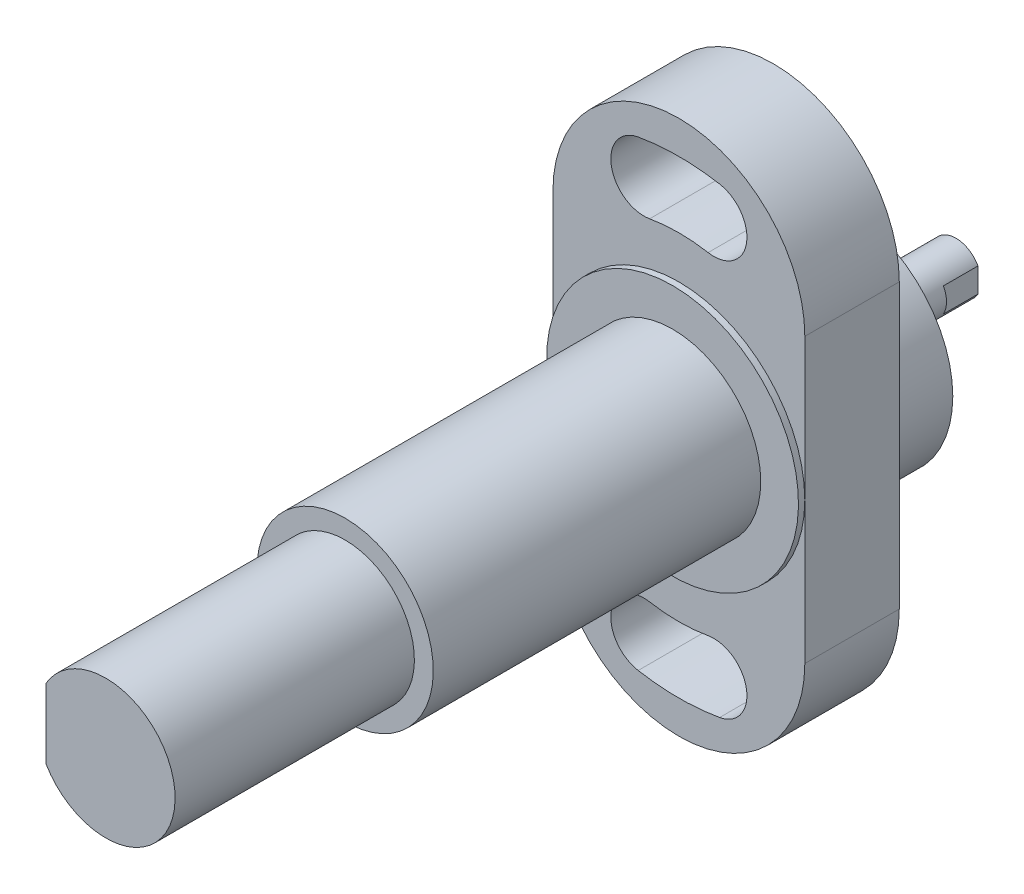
ISO-10303-21;
HEADER;
FILE_DESCRIPTION(('STEP AP214'),'2;1');
FILE_NAME('part.step','',(''),(''),'','','');
FILE_SCHEMA(('AUTOMOTIVE_DESIGN { 1 0 10303 214 1 1 1 1 }'));
ENDSEC;
DATA;
#1=APPLICATION_CONTEXT('core data for automotive mechanical design processes');
#2=APPLICATION_PROTOCOL_DEFINITION('international standard','automotive_design',2000,#1);
#3=PRODUCT_CONTEXT('',#1,'mechanical');
#4=PRODUCT('Part','Part','',(#3));
#5=PRODUCT_RELATED_PRODUCT_CATEGORY('part','',(#4));
#6=PRODUCT_DEFINITION_FORMATION('','',#4);
#7=PRODUCT_DEFINITION_CONTEXT('part definition',#1,'design');
#8=PRODUCT_DEFINITION('design','',#6,#7);
#9=PRODUCT_DEFINITION_SHAPE('','',#8);
#10=(LENGTH_UNIT() NAMED_UNIT(*) SI_UNIT(.MILLI.,.METRE.));
#11=(NAMED_UNIT(*) PLANE_ANGLE_UNIT() SI_UNIT($,.RADIAN.));
#12=(NAMED_UNIT(*) SI_UNIT($,.STERADIAN.) SOLID_ANGLE_UNIT());
#13=UNCERTAINTY_MEASURE_WITH_UNIT(LENGTH_MEASURE(1.E-05),#10,'distance_accuracy_value','');
#14=(GEOMETRIC_REPRESENTATION_CONTEXT(3) GLOBAL_UNCERTAINTY_ASSIGNED_CONTEXT((#13)) GLOBAL_UNIT_ASSIGNED_CONTEXT((#10,
#11,#12)) REPRESENTATION_CONTEXT('',''));
#15=CARTESIAN_POINT('',(0.,0.,0.));
#16=DIRECTION('',(0.,0.,1.));
#17=DIRECTION('',(1.,0.,0.));
#18=AXIS2_PLACEMENT_3D('',#15,#16,#17);
#19=CARTESIAN_POINT('',(-10.,0.,-11.));
#20=DIRECTION('',(0.,0.,-1.));
#21=DIRECTION('',(0.,1.,0.));
#22=AXIS2_PLACEMENT_3D('',#19,#20,#21);
#23=PLANE('',#22);
#24=CARTESIAN_POINT('',(0.,0.,-11.));
#25=DIRECTION('',(0.,0.,1.));
#26=DIRECTION('',(0.,1.,0.));
#27=AXIS2_PLACEMENT_3D('',#24,#25,#26);
#28=CIRCLE('',#27,17.5);
#29=CARTESIAN_POINT('',(0.,17.5,-11.));
#30=VERTEX_POINT('',#29);
#31=EDGE_CURVE('E212',#30,#30,#28,.T.);
#32=ORIENTED_EDGE('',*,*,#31,.F.);
#33=EDGE_LOOP('',(#32));
#34=FACE_BOUND('',#33,.T.);
#35=CARTESIAN_POINT('',(0.,0.,-11.));
#36=DIRECTION('',(0.,0.,-1.));
#37=DIRECTION('',(-1.,0.,0.));
#38=AXIS2_PLACEMENT_3D('',#35,#36,#37);
#39=CIRCLE('',#38,4.);
#40=CARTESIAN_POINT('',(-4.,0.,-11.));
#41=VERTEX_POINT('',#40);
#42=EDGE_CURVE('E180',#41,#41,#39,.T.);
#43=ORIENTED_EDGE('',*,*,#42,.F.);
#44=EDGE_LOOP('',(#43));
#45=FACE_BOUND('',#44,.T.);
#46=ADVANCED_FACE('F14',(#34,#45),#23,.T.);
#47=CARTESIAN_POINT('',(-9.5,0.,101.));
#48=DIRECTION('',(-1.,0.,0.));
#49=DIRECTION('',(0.,1.,0.));
#50=AXIS2_PLACEMENT_3D('',#47,#48,#49);
#51=CONICAL_SURFACE('',#50,2.65,0.785398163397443);
#52=CARTESIAN_POINT('',(-9.35,0.,101.));
#53=DIRECTION('',(-1.,0.,0.));
#54=DIRECTION('',(0.,0.,1.));
#55=AXIS2_PLACEMENT_3D('',#52,#53,#54);
#56=CIRCLE('',#55,2.5);
#57=CARTESIAN_POINT('',(-9.35,0.,103.5));
#58=VERTEX_POINT('',#57);
#59=EDGE_CURVE('E329',#58,#58,#56,.F.);
#60=ORIENTED_EDGE('',*,*,#59,.T.);
#61=EDGE_LOOP('',(#60));
#62=FACE_BOUND('',#61,.T.);
#63=CARTESIAN_POINT('',(-9.5,0.,101.));
#64=DIRECTION('',(1.,0.,0.));
#65=DIRECTION('',(0.,1.,0.));
#66=AXIS2_PLACEMENT_3D('',#63,#64,#65);
#67=CIRCLE('',#66,2.65);
#68=CARTESIAN_POINT('',(-9.5,2.65,101.));
#69=VERTEX_POINT('',#68);
#70=EDGE_CURVE('E215',#69,#69,#67,.T.);
#71=ORIENTED_EDGE('',*,*,#70,.F.);
#72=EDGE_LOOP('',(#71));
#73=FACE_BOUND('',#72,.T.);
#74=ADVANCED_FACE('F367',(#62,#73),#51,.F.);
#75=CARTESIAN_POINT('',(-9.5,10.,95.));
#76=DIRECTION('',(0.5,0.,-0.866025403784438));
#77=DIRECTION('',(-0.866025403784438,0.,-0.5));
#78=AXIS2_PLACEMENT_3D('',#75,#76,#77);
#79=PLANE('',#78);
#80=CARTESIAN_POINT('',(0.,0.,100.484827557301));
#81=DIRECTION('',(-0.5,0.,0.866025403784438));
#82=DIRECTION('',(-0.866025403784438,0.,-0.5));
#83=AXIS2_PLACEMENT_3D('',#80,#81,#82);
#84=ELLIPSE('',#83,12.7017059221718,11.);
#85=CARTESIAN_POINT('',(-9.5,5.54526825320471,95.));
#86=VERTEX_POINT('',#85);
#87=CARTESIAN_POINT('',(-9.5,-5.54526825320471,95.));
#88=VERTEX_POINT('',#87);
#89=EDGE_CURVE('E23',#86,#88,#84,.T.);
#90=ORIENTED_EDGE('',*,*,#89,.T.);
#91=DIRECTION('',(0.,-1.,0.));
#92=VECTOR('',#91,1.);
#93=CARTESIAN_POINT('',(-9.5,10.,95.));
#94=LINE('',#93,#92);
#95=EDGE_CURVE('E221',#86,#88,#94,.T.);
#96=ORIENTED_EDGE('',*,*,#95,.F.);
#97=EDGE_LOOP('',(#90,#96));
#98=FACE_BOUND('',#97,.T.);
#99=ADVANCED_FACE('F374',(#98),#79,.F.);
#100=CARTESIAN_POINT('',(-9.5,10.,106.));
#101=DIRECTION('',(1.,0.,0.));
#102=DIRECTION('',(0.,0.,-1.));
#103=AXIS2_PLACEMENT_3D('',#100,#101,#102);
#104=PLANE('',#103);
#105=DIRECTION('',(0.,1.,0.));
#106=VECTOR('',#105,1.);
#107=CARTESIAN_POINT('',(-9.5,5.54526825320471,106.));
#108=LINE('',#107,#106);
#109=CARTESIAN_POINT('',(-9.5,-5.54526825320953,106.));
#110=VERTEX_POINT('',#109);
#111=CARTESIAN_POINT('',(-9.5,5.54526825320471,106.));
#112=VERTEX_POINT('',#111);
#113=EDGE_CURVE('E202',#110,#112,#108,.T.);
#114=ORIENTED_EDGE('',*,*,#113,.T.);
#115=DIRECTION('',(0.,0.,-1.));
#116=VECTOR('',#115,1.);
#117=CARTESIAN_POINT('',(-9.5,5.54526825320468,0.));
#118=LINE('',#117,#116);
#119=EDGE_CURVE('E227',#112,#86,#118,.T.);
#120=ORIENTED_EDGE('',*,*,#119,.T.);
#121=ORIENTED_EDGE('',*,*,#95,.T.);
#122=DIRECTION('',(0.,0.,-1.));
#123=VECTOR('',#122,1.);
#124=CARTESIAN_POINT('',(-9.5,-5.54526825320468,0.));
#125=LINE('',#124,#123);
#126=EDGE_CURVE('E224',#88,#110,#125,.F.);
#127=ORIENTED_EDGE('',*,*,#126,.T.);
#128=EDGE_LOOP('',(#114,#120,#121,#127));
#129=FACE_BOUND('',#128,.T.);
#130=ORIENTED_EDGE('',*,*,#70,.T.);
#131=EDGE_LOOP('',(#130));
#132=FACE_BOUND('',#131,.T.);
#133=ADVANCED_FACE('F395',(#129,#132),#104,.F.);
#134=CARTESIAN_POINT('',(0.,0.,0.));
#135=DIRECTION('',(0.,0.,-1.));
#136=DIRECTION('',(0.,1.,0.));
#137=AXIS2_PLACEMENT_3D('',#134,#135,#136);
#138=CYLINDRICAL_SURFACE('',#137,11.);
#139=ORIENTED_EDGE('',*,*,#119,.F.);
#140=CARTESIAN_POINT('',(0.,0.,106.));
#141=DIRECTION('',(0.,0.,-1.));
#142=DIRECTION('',(1.,0.,0.));
#143=AXIS2_PLACEMENT_3D('',#140,#141,#142);
#144=CIRCLE('',#143,11.0000000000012);
#145=EDGE_CURVE('E200',#112,#110,#144,.T.);
#146=ORIENTED_EDGE('',*,*,#145,.T.);
#147=ORIENTED_EDGE('',*,*,#126,.F.);
#148=ORIENTED_EDGE('',*,*,#89,.F.);
#149=EDGE_LOOP('',(#139,#146,#147,#148));
#150=FACE_BOUND('',#149,.T.);
#151=CARTESIAN_POINT('',(0.,0.,68.));
#152=DIRECTION('',(0.,0.,1.));
#153=DIRECTION('',(0.,1.,0.));
#154=AXIS2_PLACEMENT_3D('',#151,#152,#153);
#155=CIRCLE('',#154,11.);
#156=CARTESIAN_POINT('',(0.,11.,68.));
#157=VERTEX_POINT('',#156);
#158=EDGE_CURVE('E282',#157,#157,#155,.T.);
#159=ORIENTED_EDGE('',*,*,#158,.T.);
#160=EDGE_LOOP('',(#159));
#161=FACE_BOUND('',#160,.T.);
#162=ADVANCED_FACE('F399',(#150,#161),#138,.T.);
#163=CARTESIAN_POINT('',(-14.,0.,68.));
#164=DIRECTION('',(0.,0.,-1.));
#165=DIRECTION('',(0.,1.,0.));
#166=AXIS2_PLACEMENT_3D('',#163,#164,#165);
#167=PLANE('',#166);
#168=CARTESIAN_POINT('',(0.,0.,68.));
#169=DIRECTION('',(0.,0.,1.));
#170=DIRECTION('',(0.,1.,0.));
#171=AXIS2_PLACEMENT_3D('',#168,#169,#170);
#172=CIRCLE('',#171,14.);
#173=CARTESIAN_POINT('',(0.,14.,68.));
#174=VERTEX_POINT('',#173);
#175=EDGE_CURVE('E290',#174,#174,#172,.T.);
#176=ORIENTED_EDGE('',*,*,#175,.T.);
#177=EDGE_LOOP('',(#176));
#178=FACE_BOUND('',#177,.T.);
#179=ORIENTED_EDGE('',*,*,#158,.F.);
#180=EDGE_LOOP('',(#179));
#181=FACE_BOUND('',#180,.T.);
#182=ADVANCED_FACE('F436',(#178,#181),#167,.F.);
#183=CARTESIAN_POINT('',(0.,0.,0.));
#184=DIRECTION('',(0.,0.,-1.));
#185=DIRECTION('',(0.,1.,0.));
#186=AXIS2_PLACEMENT_3D('',#183,#184,#185);
#187=CYLINDRICAL_SURFACE('',#186,14.);
#188=ORIENTED_EDGE('',*,*,#175,.F.);
#189=EDGE_LOOP('',(#188));
#190=FACE_BOUND('',#189,.T.);
#191=CARTESIAN_POINT('',(0.,0.,16.));
#192=DIRECTION('',(0.,0.,-1.));
#193=DIRECTION('',(0.,-1.,0.));
#194=AXIS2_PLACEMENT_3D('',#191,#192,#193);
#195=CIRCLE('',#194,14.);
#196=CARTESIAN_POINT('',(0.,-14.,16.));
#197=VERTEX_POINT('',#196);
#198=EDGE_CURVE('E322',#197,#197,#195,.F.);
#199=ORIENTED_EDGE('',*,*,#198,.T.);
#200=EDGE_LOOP('',(#199));
#201=FACE_BOUND('',#200,.T.);
#202=ADVANCED_FACE('F440',(#190,#201),#187,.T.);
#203=CARTESIAN_POINT('',(-14.,0.,16.));
#204=DIRECTION('',(0.,0.,1.));
#205=DIRECTION('',(0.,-1.,0.));
#206=AXIS2_PLACEMENT_3D('',#203,#204,#205);
#207=PLANE('',#206);
#208=ORIENTED_EDGE('',*,*,#198,.F.);
#209=EDGE_LOOP('',(#208));
#210=FACE_BOUND('',#209,.T.);
#211=CARTESIAN_POINT('',(0.,0.,16.));
#212=DIRECTION('',(0.,0.,1.));
#213=DIRECTION('',(0.,1.,0.));
#214=AXIS2_PLACEMENT_3D('',#211,#212,#213);
#215=CIRCLE('',#214,19.995);
#216=CARTESIAN_POINT('',(0.,19.995,16.));
#217=VERTEX_POINT('',#216);
#218=EDGE_CURVE('E319',#217,#217,#215,.T.);
#219=ORIENTED_EDGE('',*,*,#218,.T.);
#220=EDGE_LOOP('',(#219));
#221=FACE_BOUND('',#220,.T.);
#222=ADVANCED_FACE('F466',(#210,#221),#207,.T.);
#223=CARTESIAN_POINT('',(-20.,-13.,8.));
#224=DIRECTION('',(-1.,0.,0.));
#225=DIRECTION('',(0.,1.,0.));
#226=AXIS2_PLACEMENT_3D('',#223,#224,#225);
#227=CONICAL_SURFACE('',#226,2.65,0.78539816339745);
#228=CARTESIAN_POINT('',(-19.85,-13.,8.));
#229=DIRECTION('',(-1.,0.,0.));
#230=DIRECTION('',(0.,0.,1.));
#231=AXIS2_PLACEMENT_3D('',#228,#229,#230);
#232=CIRCLE('',#231,2.5);
#233=CARTESIAN_POINT('',(-19.85,-13.,10.5));
#234=VERTEX_POINT('',#233);
#235=EDGE_CURVE('E335',#234,#234,#232,.F.);
#236=ORIENTED_EDGE('',*,*,#235,.T.);
#237=EDGE_LOOP('',(#236));
#238=FACE_BOUND('',#237,.T.);
#239=CARTESIAN_POINT('',(-20.,-13.,8.));
#240=DIRECTION('',(1.,0.,0.));
#241=DIRECTION('',(0.,1.,0.));
#242=AXIS2_PLACEMENT_3D('',#239,#240,#241);
#243=CIRCLE('',#242,2.65);
#244=CARTESIAN_POINT('',(-20.,-10.35,8.));
#245=VERTEX_POINT('',#244);
#246=EDGE_CURVE('E205',#245,#245,#243,.T.);
#247=ORIENTED_EDGE('',*,*,#246,.F.);
#248=EDGE_LOOP('',(#247));
#249=FACE_BOUND('',#248,.T.);
#250=ADVANCED_FACE('F464',(#238,#249),#227,.F.);
#251=CARTESIAN_POINT('',(0.,0.,0.));
#252=DIRECTION('',(0.,0.,-1.));
#253=DIRECTION('',(0.,1.,0.));
#254=AXIS2_PLACEMENT_3D('',#251,#252,#253);
#255=CYLINDRICAL_SURFACE('',#254,19.995);
#256=ORIENTED_EDGE('',*,*,#218,.F.);
#257=EDGE_LOOP('',(#256));
#258=FACE_BOUND('',#257,.T.);
#259=CARTESIAN_POINT('',(0.,0.,15.));
#260=DIRECTION('',(0.,0.,-1.));
#261=DIRECTION('',(0.,-1.,0.));
#262=AXIS2_PLACEMENT_3D('',#259,#260,#261);
#263=CIRCLE('',#262,19.995);
#264=CARTESIAN_POINT('',(0.,-19.995,15.));
#265=VERTEX_POINT('',#264);
#266=EDGE_CURVE('E293',#265,#265,#263,.T.);
#267=ORIENTED_EDGE('',*,*,#266,.F.);
#268=EDGE_LOOP('',(#267));
#269=FACE_BOUND('',#268,.T.);
#270=ADVANCED_FACE('F450',(#258,#269),#255,.T.);
#271=CARTESIAN_POINT('',(20.,22.5,15.));
#272=DIRECTION('',(-1.,0.,0.));
#273=DIRECTION('',(0.,1.,0.));
#274=AXIS2_PLACEMENT_3D('',#271,#272,#273);
#275=PLANE('',#274);
#276=DIRECTION('',(0.,0.,-1.));
#277=VECTOR('',#276,1.);
#278=CARTESIAN_POINT('',(20.,22.5,15.));
#279=LINE('',#278,#277);
#280=CARTESIAN_POINT('',(20.,22.5,15.));
#281=VERTEX_POINT('',#280);
#282=CARTESIAN_POINT('',(20.,22.5,0.));
#283=VERTEX_POINT('',#282);
#284=EDGE_CURVE('E310',#281,#283,#279,.T.);
#285=ORIENTED_EDGE('',*,*,#284,.F.);
#286=DIRECTION('',(0.,-1.,0.));
#287=VECTOR('',#286,1.);
#288=CARTESIAN_POINT('',(20.,22.5,15.));
#289=LINE('',#288,#287);
#290=CARTESIAN_POINT('',(20.,-22.5,15.));
#291=VERTEX_POINT('',#290);
#292=EDGE_CURVE('E304',#281,#291,#289,.T.);
#293=ORIENTED_EDGE('',*,*,#292,.T.);
#294=DIRECTION('',(0.,0.,-1.));
#295=VECTOR('',#294,1.);
#296=CARTESIAN_POINT('',(20.,-22.5,15.));
#297=LINE('',#296,#295);
#298=CARTESIAN_POINT('',(20.,-22.5,0.));
#299=VERTEX_POINT('',#298);
#300=EDGE_CURVE('E307',#291,#299,#297,.T.);
#301=ORIENTED_EDGE('',*,*,#300,.T.);
#302=DIRECTION('',(0.,1.,0.));
#303=VECTOR('',#302,1.);
#304=CARTESIAN_POINT('',(20.,-22.5,0.));
#305=LINE('',#304,#303);
#306=EDGE_CURVE('E190',#299,#283,#305,.T.);
#307=ORIENTED_EDGE('',*,*,#306,.T.);
#308=EDGE_LOOP('',(#285,#293,#301,#307));
#309=FACE_BOUND('',#308,.T.);
#310=ADVANCED_FACE('F446',(#309),#275,.F.);
#311=CARTESIAN_POINT('',(0.,-22.5,15.));
#312=DIRECTION('',(0.,0.,-1.));
#313=DIRECTION('',(0.,1.,0.));
#314=AXIS2_PLACEMENT_3D('',#311,#312,#313);
#315=CYLINDRICAL_SURFACE('',#314,20.);
#316=ORIENTED_EDGE('',*,*,#300,.F.);
#317=CARTESIAN_POINT('',(0.,-22.5,15.));
#318=DIRECTION('',(0.,0.,-1.));
#319=DIRECTION('',(0.,1.,0.));
#320=AXIS2_PLACEMENT_3D('',#317,#318,#319);
#321=CIRCLE('',#320,20.);
#322=CARTESIAN_POINT('',(-20.,-22.5,15.));
#323=VERTEX_POINT('',#322);
#324=EDGE_CURVE('E296',#291,#323,#321,.T.);
#325=ORIENTED_EDGE('',*,*,#324,.T.);
#326=DIRECTION('',(0.,0.,-1.));
#327=VECTOR('',#326,1.);
#328=CARTESIAN_POINT('',(-20.,-22.5,15.));
#329=LINE('',#328,#327);
#330=CARTESIAN_POINT('',(-20.,-22.5,0.));
#331=VERTEX_POINT('',#330);
#332=EDGE_CURVE('E316',#323,#331,#329,.T.);
#333=ORIENTED_EDGE('',*,*,#332,.T.);
#334=CARTESIAN_POINT('',(0.,-22.5,0.));
#335=DIRECTION('',(0.,0.,1.));
#336=DIRECTION('',(-1.,0.,0.));
#337=AXIS2_PLACEMENT_3D('',#334,#335,#336);
#338=CIRCLE('',#337,20.);
#339=EDGE_CURVE('E186',#331,#299,#338,.T.);
#340=ORIENTED_EDGE('',*,*,#339,.T.);
#341=EDGE_LOOP('',(#316,#325,#333,#340));
#342=FACE_BOUND('',#341,.T.);
#343=ADVANCED_FACE('F449',(#342),#315,.T.);
#344=CARTESIAN_POINT('',(-20.,22.5,15.));
#345=DIRECTION('',(1.,0.,0.));
#346=DIRECTION('',(0.,-1.,0.));
#347=AXIS2_PLACEMENT_3D('',#344,#345,#346);
#348=PLANE('',#347);
#349=ORIENTED_EDGE('',*,*,#246,.T.);
#350=EDGE_LOOP('',(#349));
#351=FACE_BOUND('',#350,.T.);
#352=ORIENTED_EDGE('',*,*,#332,.F.);
#353=DIRECTION('',(0.,1.,0.));
#354=VECTOR('',#353,1.);
#355=CARTESIAN_POINT('',(-20.,22.5,15.));
#356=LINE('',#355,#354);
#357=CARTESIAN_POINT('',(-20.,22.5,15.));
#358=VERTEX_POINT('',#357);
#359=EDGE_CURVE('E299',#323,#358,#356,.T.);
#360=ORIENTED_EDGE('',*,*,#359,.T.);
#361=DIRECTION('',(0.,0.,-1.));
#362=VECTOR('',#361,1.);
#363=CARTESIAN_POINT('',(-20.,22.5,15.));
#364=LINE('',#363,#362);
#365=CARTESIAN_POINT('',(-20.,22.5,0.));
#366=VERTEX_POINT('',#365);
#367=EDGE_CURVE('E313',#358,#366,#364,.T.);
#368=ORIENTED_EDGE('',*,*,#367,.T.);
#369=DIRECTION('',(0.,-1.,0.));
#370=VECTOR('',#369,1.);
#371=CARTESIAN_POINT('',(-20.,22.5,0.));
#372=LINE('',#371,#370);
#373=EDGE_CURVE('E195',#366,#331,#372,.T.);
#374=ORIENTED_EDGE('',*,*,#373,.T.);
#375=EDGE_LOOP('',(#352,#360,#368,#374));
#376=FACE_BOUND('',#375,.T.);
#377=ADVANCED_FACE('F454',(#351,#376),#348,.F.);
#378=CARTESIAN_POINT('',(0.,22.5,15.));
#379=DIRECTION('',(0.,0.,-1.));
#380=DIRECTION('',(0.,1.,0.));
#381=AXIS2_PLACEMENT_3D('',#378,#379,#380);
#382=CYLINDRICAL_SURFACE('',#381,20.);
#383=ORIENTED_EDGE('',*,*,#367,.F.);
#384=CARTESIAN_POINT('',(0.,22.5,15.));
#385=DIRECTION('',(0.,0.,-1.));
#386=DIRECTION('',(0.,-1.,0.));
#387=AXIS2_PLACEMENT_3D('',#384,#385,#386);
#388=CIRCLE('',#387,20.);
#389=EDGE_CURVE('E302',#358,#281,#388,.T.);
#390=ORIENTED_EDGE('',*,*,#389,.T.);
#391=ORIENTED_EDGE('',*,*,#284,.T.);
#392=CARTESIAN_POINT('',(0.,22.5,0.));
#393=DIRECTION('',(0.,0.,1.));
#394=DIRECTION('',(-1.,0.,0.));
#395=AXIS2_PLACEMENT_3D('',#392,#393,#394);
#396=CIRCLE('',#395,20.);
#397=EDGE_CURVE('E193',#283,#366,#396,.T.);
#398=ORIENTED_EDGE('',*,*,#397,.T.);
#399=EDGE_LOOP('',(#383,#390,#391,#398));
#400=FACE_BOUND('',#399,.T.);
#401=ADVANCED_FACE('F444',(#400),#382,.T.);
#402=CARTESIAN_POINT('',(0.,-22.5,15.));
#403=DIRECTION('',(0.,0.,-1.));
#404=DIRECTION('',(0.,1.,0.));
#405=AXIS2_PLACEMENT_3D('',#402,#403,#404);
#406=PLANE('',#405);
#407=CARTESIAN_POINT('',(0.,0.,15.));
#408=DIRECTION('',(0.,0.,1.));
#409=DIRECTION('',(0.,-1.,0.));
#410=AXIS2_PLACEMENT_3D('',#407,#408,#409);
#411=CIRCLE('',#410,26.75);
#412=CARTESIAN_POINT('',(4.64508875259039,26.3436073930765,15.));
#413=VERTEX_POINT('',#412);
#414=CARTESIAN_POINT('',(-4.64508875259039,26.3436073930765,15.));
#415=VERTEX_POINT('',#414);
#416=EDGE_CURVE('E243',#413,#415,#411,.T.);
#417=ORIENTED_EDGE('',*,*,#416,.T.);
#418=CARTESIAN_POINT('',(-5.55674168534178,31.5138480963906,15.));
#419=DIRECTION('',(0.,0.,-1.));
#420=DIRECTION('',(0.,-1.,0.));
#421=AXIS2_PLACEMENT_3D('',#418,#419,#420);
#422=CIRCLE('',#421,5.25);
#423=CARTESIAN_POINT('',(-6.46839461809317,36.6840887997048,15.));
#424=VERTEX_POINT('',#423);
#425=EDGE_CURVE('E246',#415,#424,#422,.T.);
#426=ORIENTED_EDGE('',*,*,#425,.T.);
#427=CARTESIAN_POINT('',(0.,0.,15.));
#428=DIRECTION('',(0.,0.,-1.));
#429=DIRECTION('',(0.,-1.,0.));
#430=AXIS2_PLACEMENT_3D('',#427,#428,#429);
#431=CIRCLE('',#430,37.25);
#432=CARTESIAN_POINT('',(6.46839461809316,36.6840887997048,15.));
#433=VERTEX_POINT('',#432);
#434=EDGE_CURVE('E233',#424,#433,#431,.T.);
#435=ORIENTED_EDGE('',*,*,#434,.T.);
#436=CARTESIAN_POINT('',(5.55674168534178,31.5138480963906,15.));
#437=DIRECTION('',(0.,0.,-1.));
#438=DIRECTION('',(0.,1.,0.));
#439=AXIS2_PLACEMENT_3D('',#436,#437,#438);
#440=CIRCLE('',#439,5.25);
#441=EDGE_CURVE('E229',#433,#413,#440,.T.);
#442=ORIENTED_EDGE('',*,*,#441,.T.);
#443=EDGE_LOOP('',(#417,#426,#435,#442));
#444=FACE_BOUND('',#443,.T.);
#445=CARTESIAN_POINT('',(5.55674168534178,-31.5138480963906,15.));
#446=DIRECTION('',(0.,0.,-1.));
#447=DIRECTION('',(0.,-1.,0.));
#448=AXIS2_PLACEMENT_3D('',#445,#446,#447);
#449=CIRCLE('',#448,5.25);
#450=CARTESIAN_POINT('',(4.6450887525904,-26.3436073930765,15.));
#451=VERTEX_POINT('',#450);
#452=CARTESIAN_POINT('',(6.46839461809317,-36.6840887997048,15.));
#453=VERTEX_POINT('',#452);
#454=EDGE_CURVE('E272',#451,#453,#449,.T.);
#455=ORIENTED_EDGE('',*,*,#454,.T.);
#456=CARTESIAN_POINT('',(0.,0.,15.));
#457=DIRECTION('',(0.,0.,-1.));
#458=DIRECTION('',(0.,1.,0.));
#459=AXIS2_PLACEMENT_3D('',#456,#457,#458);
#460=CIRCLE('',#459,37.25);
#461=CARTESIAN_POINT('',(-6.46839461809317,-36.6840887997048,15.));
#462=VERTEX_POINT('',#461);
#463=EDGE_CURVE('E275',#453,#462,#460,.T.);
#464=ORIENTED_EDGE('',*,*,#463,.T.);
#465=CARTESIAN_POINT('',(-5.55674168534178,-31.5138480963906,15.));
#466=DIRECTION('',(0.,0.,-1.));
#467=DIRECTION('',(0.,1.,0.));
#468=AXIS2_PLACEMENT_3D('',#465,#466,#467);
#469=CIRCLE('',#468,5.25);
#470=CARTESIAN_POINT('',(-4.64508875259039,-26.3436073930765,15.));
#471=VERTEX_POINT('',#470);
#472=EDGE_CURVE('E262',#462,#471,#469,.T.);
#473=ORIENTED_EDGE('',*,*,#472,.T.);
#474=CARTESIAN_POINT('',(0.,0.,15.));
#475=DIRECTION('',(0.,0.,1.));
#476=DIRECTION('',(0.,1.,0.));
#477=AXIS2_PLACEMENT_3D('',#474,#475,#476);
#478=CIRCLE('',#477,26.75);
#479=EDGE_CURVE('E253',#471,#451,#478,.T.);
#480=ORIENTED_EDGE('',*,*,#479,.T.);
#481=EDGE_LOOP('',(#455,#464,#473,#480));
#482=FACE_BOUND('',#481,.T.);
#483=ORIENTED_EDGE('',*,*,#324,.F.);
#484=ORIENTED_EDGE('',*,*,#292,.F.);
#485=ORIENTED_EDGE('',*,*,#389,.F.);
#486=ORIENTED_EDGE('',*,*,#359,.F.);
#487=EDGE_LOOP('',(#483,#484,#485,#486));
#488=FACE_BOUND('',#487,.T.);
#489=ORIENTED_EDGE('',*,*,#266,.T.);
#490=EDGE_LOOP('',(#489));
#491=FACE_BOUND('',#490,.T.);
#492=ADVANCED_FACE('F422',(#444,#482,#488,#491),#406,.F.);
#493=CARTESIAN_POINT('',(-5.55674168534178,-31.5138480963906,0.));
#494=DIRECTION('',(0.,0.,1.));
#495=DIRECTION('',(0.,-1.,0.));
#496=AXIS2_PLACEMENT_3D('',#493,#494,#495);
#497=CYLINDRICAL_SURFACE('',#496,5.25);
#498=DIRECTION('',(0.,0.,1.));
#499=VECTOR('',#498,1.);
#500=CARTESIAN_POINT('',(-6.46839461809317,-36.6840887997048,0.));
#501=LINE('',#500,#499);
#502=CARTESIAN_POINT('',(-6.46839461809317,-36.6840887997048,0.));
#503=VERTEX_POINT('',#502);
#504=EDGE_CURVE('E283',#503,#462,#501,.T.);
#505=ORIENTED_EDGE('',*,*,#504,.F.);
#506=CARTESIAN_POINT('',(-5.55674168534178,-31.5138480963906,0.));
#507=DIRECTION('',(0.,0.,-1.));
#508=DIRECTION('',(0.,1.,0.));
#509=AXIS2_PLACEMENT_3D('',#506,#507,#508);
#510=CIRCLE('',#509,5.25);
#511=CARTESIAN_POINT('',(-4.64508875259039,-26.3436073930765,0.));
#512=VERTEX_POINT('',#511);
#513=EDGE_CURVE('E266',#503,#512,#510,.T.);
#514=ORIENTED_EDGE('',*,*,#513,.T.);
#515=DIRECTION('',(0.,0.,1.));
#516=VECTOR('',#515,1.);
#517=CARTESIAN_POINT('',(-4.64508875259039,-26.3436073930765,0.));
#518=LINE('',#517,#516);
#519=EDGE_CURVE('E280',#512,#471,#518,.T.);
#520=ORIENTED_EDGE('',*,*,#519,.T.);
#521=ORIENTED_EDGE('',*,*,#472,.F.);
#522=EDGE_LOOP('',(#505,#514,#520,#521));
#523=FACE_BOUND('',#522,.T.);
#524=ADVANCED_FACE('F418',(#523),#497,.F.);
#525=CARTESIAN_POINT('',(0.,0.,0.));
#526=DIRECTION('',(0.,0.,1.));
#527=DIRECTION('',(0.,-1.,0.));
#528=AXIS2_PLACEMENT_3D('',#525,#526,#527);
#529=CYLINDRICAL_SURFACE('',#528,37.25);
#530=DIRECTION('',(0.,0.,1.));
#531=VECTOR('',#530,1.);
#532=CARTESIAN_POINT('',(6.46839461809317,-36.6840887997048,0.));
#533=LINE('',#532,#531);
#534=CARTESIAN_POINT('',(6.46839461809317,-36.6840887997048,0.));
#535=VERTEX_POINT('',#534);
#536=EDGE_CURVE('E285',#535,#453,#533,.T.);
#537=ORIENTED_EDGE('',*,*,#536,.F.);
#538=CARTESIAN_POINT('',(0.,0.,0.));
#539=DIRECTION('',(0.,0.,-1.));
#540=DIRECTION('',(0.,1.,0.));
#541=AXIS2_PLACEMENT_3D('',#538,#539,#540);
#542=CIRCLE('',#541,37.25);
#543=EDGE_CURVE('E264',#535,#503,#542,.T.);
#544=ORIENTED_EDGE('',*,*,#543,.T.);
#545=ORIENTED_EDGE('',*,*,#504,.T.);
#546=ORIENTED_EDGE('',*,*,#463,.F.);
#547=EDGE_LOOP('',(#537,#544,#545,#546));
#548=FACE_BOUND('',#547,.T.);
#549=ADVANCED_FACE('F421',(#548),#529,.F.);
#550=CARTESIAN_POINT('',(5.55674168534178,-31.5138480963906,0.));
#551=DIRECTION('',(0.,0.,1.));
#552=DIRECTION('',(0.,-1.,0.));
#553=AXIS2_PLACEMENT_3D('',#550,#551,#552);
#554=CYLINDRICAL_SURFACE('',#553,5.25);
#555=DIRECTION('',(0.,0.,1.));
#556=VECTOR('',#555,1.);
#557=CARTESIAN_POINT('',(4.6450887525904,-26.3436073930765,0.));
#558=LINE('',#557,#556);
#559=CARTESIAN_POINT('',(4.6450887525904,-26.3436073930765,0.));
#560=VERTEX_POINT('',#559);
#561=EDGE_CURVE('E269',#560,#451,#558,.T.);
#562=ORIENTED_EDGE('',*,*,#561,.F.);
#563=CARTESIAN_POINT('',(5.55674168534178,-31.5138480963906,0.));
#564=DIRECTION('',(0.,0.,-1.));
#565=DIRECTION('',(0.,-1.,0.));
#566=AXIS2_PLACEMENT_3D('',#563,#564,#565);
#567=CIRCLE('',#566,5.25);
#568=EDGE_CURVE('E261',#560,#535,#567,.T.);
#569=ORIENTED_EDGE('',*,*,#568,.T.);
#570=ORIENTED_EDGE('',*,*,#536,.T.);
#571=ORIENTED_EDGE('',*,*,#454,.F.);
#572=EDGE_LOOP('',(#562,#569,#570,#571));
#573=FACE_BOUND('',#572,.T.);
#574=ADVANCED_FACE('F426',(#573),#554,.F.);
#575=CARTESIAN_POINT('',(0.,0.,0.));
#576=DIRECTION('',(0.,0.,1.));
#577=DIRECTION('',(0.,-1.,0.));
#578=AXIS2_PLACEMENT_3D('',#575,#576,#577);
#579=CYLINDRICAL_SURFACE('',#578,26.75);
#580=ORIENTED_EDGE('',*,*,#519,.F.);
#581=CARTESIAN_POINT('',(0.,0.,0.));
#582=DIRECTION('',(0.,0.,1.));
#583=DIRECTION('',(0.,1.,0.));
#584=AXIS2_PLACEMENT_3D('',#581,#582,#583);
#585=CIRCLE('',#584,26.75);
#586=EDGE_CURVE('E259',#512,#560,#585,.T.);
#587=ORIENTED_EDGE('',*,*,#586,.T.);
#588=ORIENTED_EDGE('',*,*,#561,.T.);
#589=ORIENTED_EDGE('',*,*,#479,.F.);
#590=EDGE_LOOP('',(#580,#587,#588,#589));
#591=FACE_BOUND('',#590,.T.);
#592=ADVANCED_FACE('F405',(#591),#579,.T.);
#593=CARTESIAN_POINT('',(0.,0.,0.));
#594=DIRECTION('',(0.,0.,1.));
#595=DIRECTION('',(0.,-1.,0.));
#596=AXIS2_PLACEMENT_3D('',#593,#594,#595);
#597=CYLINDRICAL_SURFACE('',#596,37.25);
#598=DIRECTION('',(0.,0.,1.));
#599=VECTOR('',#598,1.);
#600=CARTESIAN_POINT('',(-6.46839461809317,36.6840887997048,0.));
#601=LINE('',#600,#599);
#602=CARTESIAN_POINT('',(-6.46839461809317,36.6840887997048,0.));
#603=VERTEX_POINT('',#602);
#604=EDGE_CURVE('E254',#603,#424,#601,.T.);
#605=ORIENTED_EDGE('',*,*,#604,.F.);
#606=CARTESIAN_POINT('',(0.,0.,0.));
#607=DIRECTION('',(0.,0.,-1.));
#608=DIRECTION('',(0.,-1.,0.));
#609=AXIS2_PLACEMENT_3D('',#606,#607,#608);
#610=CIRCLE('',#609,37.25);
#611=CARTESIAN_POINT('',(6.46839461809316,36.6840887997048,0.));
#612=VERTEX_POINT('',#611);
#613=EDGE_CURVE('E237',#603,#612,#610,.T.);
#614=ORIENTED_EDGE('',*,*,#613,.T.);
#615=DIRECTION('',(0.,0.,1.));
#616=VECTOR('',#615,1.);
#617=CARTESIAN_POINT('',(6.46839461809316,36.6840887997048,0.));
#618=LINE('',#617,#616);
#619=EDGE_CURVE('E251',#612,#433,#618,.T.);
#620=ORIENTED_EDGE('',*,*,#619,.T.);
#621=ORIENTED_EDGE('',*,*,#434,.F.);
#622=EDGE_LOOP('',(#605,#614,#620,#621));
#623=FACE_BOUND('',#622,.T.);
#624=ADVANCED_FACE('F401',(#623),#597,.F.);
#625=CARTESIAN_POINT('',(-5.55674168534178,31.5138480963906,0.));
#626=DIRECTION('',(0.,0.,1.));
#627=DIRECTION('',(0.,-1.,0.));
#628=AXIS2_PLACEMENT_3D('',#625,#626,#627);
#629=CYLINDRICAL_SURFACE('',#628,5.25);
#630=DIRECTION('',(0.,0.,1.));
#631=VECTOR('',#630,1.);
#632=CARTESIAN_POINT('',(-4.64508875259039,26.3436073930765,0.));
#633=LINE('',#632,#631);
#634=CARTESIAN_POINT('',(-4.64508875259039,26.3436073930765,0.));
#635=VERTEX_POINT('',#634);
#636=EDGE_CURVE('E256',#635,#415,#633,.T.);
#637=ORIENTED_EDGE('',*,*,#636,.F.);
#638=CARTESIAN_POINT('',(-5.55674168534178,31.5138480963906,0.));
#639=DIRECTION('',(0.,0.,-1.));
#640=DIRECTION('',(0.,-1.,0.));
#641=AXIS2_PLACEMENT_3D('',#638,#639,#640);
#642=CIRCLE('',#641,5.25);
#643=EDGE_CURVE('E235',#635,#603,#642,.T.);
#644=ORIENTED_EDGE('',*,*,#643,.T.);
#645=ORIENTED_EDGE('',*,*,#604,.T.);
#646=ORIENTED_EDGE('',*,*,#425,.F.);
#647=EDGE_LOOP('',(#637,#644,#645,#646));
#648=FACE_BOUND('',#647,.T.);
#649=ADVANCED_FACE('F404',(#648),#629,.F.);
#650=CARTESIAN_POINT('',(0.,0.,0.));
#651=DIRECTION('',(0.,0.,1.));
#652=DIRECTION('',(0.,-1.,0.));
#653=AXIS2_PLACEMENT_3D('',#650,#651,#652);
#654=CYLINDRICAL_SURFACE('',#653,26.75);
#655=DIRECTION('',(0.,0.,1.));
#656=VECTOR('',#655,1.);
#657=CARTESIAN_POINT('',(4.64508875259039,26.3436073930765,0.));
#658=LINE('',#657,#656);
#659=CARTESIAN_POINT('',(4.64508875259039,26.3436073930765,0.));
#660=VERTEX_POINT('',#659);
#661=EDGE_CURVE('E240',#660,#413,#658,.T.);
#662=ORIENTED_EDGE('',*,*,#661,.F.);
#663=CARTESIAN_POINT('',(0.,0.,0.));
#664=DIRECTION('',(0.,0.,1.));
#665=DIRECTION('',(0.,-1.,0.));
#666=AXIS2_PLACEMENT_3D('',#663,#664,#665);
#667=CIRCLE('',#666,26.75);
#668=EDGE_CURVE('E232',#660,#635,#667,.T.);
#669=ORIENTED_EDGE('',*,*,#668,.T.);
#670=ORIENTED_EDGE('',*,*,#636,.T.);
#671=ORIENTED_EDGE('',*,*,#416,.F.);
#672=EDGE_LOOP('',(#662,#669,#670,#671));
#673=FACE_BOUND('',#672,.T.);
#674=ADVANCED_FACE('F409',(#673),#654,.T.);
#675=CARTESIAN_POINT('',(5.55674168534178,31.5138480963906,0.));
#676=DIRECTION('',(0.,0.,1.));
#677=DIRECTION('',(0.,-1.,0.));
#678=AXIS2_PLACEMENT_3D('',#675,#676,#677);
#679=CYLINDRICAL_SURFACE('',#678,5.25);
#680=ORIENTED_EDGE('',*,*,#619,.F.);
#681=CARTESIAN_POINT('',(5.55674168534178,31.5138480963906,0.));
#682=DIRECTION('',(0.,0.,-1.));
#683=DIRECTION('',(0.,1.,0.));
#684=AXIS2_PLACEMENT_3D('',#681,#682,#683);
#685=CIRCLE('',#684,5.25);
#686=EDGE_CURVE('E230',#612,#660,#685,.T.);
#687=ORIENTED_EDGE('',*,*,#686,.T.);
#688=ORIENTED_EDGE('',*,*,#661,.T.);
#689=ORIENTED_EDGE('',*,*,#441,.F.);
#690=EDGE_LOOP('',(#680,#687,#688,#689));
#691=FACE_BOUND('',#690,.T.);
#692=ADVANCED_FACE('F413',(#691),#679,.F.);
#693=CARTESIAN_POINT('',(-10.,0.,0.));
#694=DIRECTION('',(0.,0.,-1.));
#695=DIRECTION('',(0.,1.,0.));
#696=AXIS2_PLACEMENT_3D('',#693,#694,#695);
#697=PLANE('',#696);
#698=CARTESIAN_POINT('',(0.,0.,0.));
#699=DIRECTION('',(0.,0.,1.));
#700=DIRECTION('',(0.,1.,0.));
#701=AXIS2_PLACEMENT_3D('',#698,#699,#700);
#702=CIRCLE('',#701,17.5);
#703=CARTESIAN_POINT('',(0.,17.5,0.));
#704=VERTEX_POINT('',#703);
#705=EDGE_CURVE('E9',#704,#704,#702,.T.);
#706=ORIENTED_EDGE('',*,*,#705,.T.);
#707=EDGE_LOOP('',(#706));
#708=FACE_BOUND('',#707,.T.);
#709=ORIENTED_EDGE('',*,*,#686,.F.);
#710=ORIENTED_EDGE('',*,*,#613,.F.);
#711=ORIENTED_EDGE('',*,*,#643,.F.);
#712=ORIENTED_EDGE('',*,*,#668,.F.);
#713=EDGE_LOOP('',(#709,#710,#711,#712));
#714=FACE_BOUND('',#713,.T.);
#715=ORIENTED_EDGE('',*,*,#586,.F.);
#716=ORIENTED_EDGE('',*,*,#513,.F.);
#717=ORIENTED_EDGE('',*,*,#543,.F.);
#718=ORIENTED_EDGE('',*,*,#568,.F.);
#719=EDGE_LOOP('',(#715,#716,#717,#718));
#720=FACE_BOUND('',#719,.T.);
#721=ORIENTED_EDGE('',*,*,#339,.F.);
#722=ORIENTED_EDGE('',*,*,#373,.F.);
#723=ORIENTED_EDGE('',*,*,#397,.F.);
#724=ORIENTED_EDGE('',*,*,#306,.F.);
#725=EDGE_LOOP('',(#721,#722,#723,#724));
#726=FACE_BOUND('',#725,.T.);
#727=ADVANCED_FACE('F16',(#708,#714,#720,#726),#697,.T.);
#728=CARTESIAN_POINT('',(0.,0.,0.));
#729=DIRECTION('',(0.,0.,-1.));
#730=DIRECTION('',(0.,1.,0.));
#731=AXIS2_PLACEMENT_3D('',#728,#729,#730);
#732=CYLINDRICAL_SURFACE('',#731,17.5);
#733=ORIENTED_EDGE('',*,*,#705,.F.);
#734=EDGE_LOOP('',(#733));
#735=FACE_BOUND('',#734,.T.);
#736=ORIENTED_EDGE('',*,*,#31,.T.);
#737=EDGE_LOOP('',(#736));
#738=FACE_BOUND('',#737,.T.);
#739=ADVANCED_FACE('F380',(#735,#738),#732,.T.);
#740=CARTESIAN_POINT('',(0.,0.,106.));
#741=DIRECTION('',(0.,0.,1.));
#742=DIRECTION('',(0.,-1.,0.));
#743=AXIS2_PLACEMENT_3D('',#740,#741,#742);
#744=PLANE('',#743);
#745=ORIENTED_EDGE('',*,*,#113,.F.);
#746=ORIENTED_EDGE('',*,*,#145,.F.);
#747=EDGE_LOOP('',(#745,#746));
#748=FACE_BOUND('',#747,.T.);
#749=ADVANCED_FACE('F470',(#748),#744,.T.);
#750=CARTESIAN_POINT('',(0.,0.,-29.));
#751=DIRECTION('',(0.,0.,1.));
#752=DIRECTION('',(1.,0.,0.));
#753=AXIS2_PLACEMENT_3D('',#750,#751,#752);
#754=CYLINDRICAL_SURFACE('',#753,4.);
#755=CARTESIAN_POINT('',(0.,0.,-29.));
#756=DIRECTION('',(0.,0.,-1.));
#757=DIRECTION('',(-1.,0.,0.));
#758=AXIS2_PLACEMENT_3D('',#755,#756,#757);
#759=CIRCLE('',#758,4.);
#760=CARTESIAN_POINT('',(-3.5,1.9364916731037,-29.));
#761=VERTEX_POINT('',#760);
#762=CARTESIAN_POINT('',(3.5,1.93649167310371,-29.));
#763=VERTEX_POINT('',#762);
#764=EDGE_CURVE('E161',#761,#763,#759,.T.);
#765=ORIENTED_EDGE('',*,*,#764,.F.);
#766=DIRECTION('',(0.,0.,-1.));
#767=VECTOR('',#766,1.);
#768=CARTESIAN_POINT('',(-3.5,1.9364916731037,-23.5));
#769=LINE('',#768,#767);
#770=CARTESIAN_POINT('',(-3.5,1.9364916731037,-23.5));
#771=VERTEX_POINT('',#770);
#772=EDGE_CURVE('E31',#771,#761,#769,.T.);
#773=ORIENTED_EDGE('',*,*,#772,.F.);
#774=CARTESIAN_POINT('',(0.,0.,-23.5));
#775=DIRECTION('',(0.,0.,-1.));
#776=DIRECTION('',(-1.,0.,0.));
#777=AXIS2_PLACEMENT_3D('',#774,#775,#776);
#778=CIRCLE('',#777,4.);
#779=CARTESIAN_POINT('',(-3.5,-1.9364916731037,-23.5));
#780=VERTEX_POINT('',#779);
#781=EDGE_CURVE('E147',#780,#771,#778,.T.);
#782=ORIENTED_EDGE('',*,*,#781,.F.);
#783=DIRECTION('',(0.,0.,-1.));
#784=VECTOR('',#783,1.);
#785=CARTESIAN_POINT('',(-3.5,-1.9364916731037,-23.5));
#786=LINE('',#785,#784);
#787=CARTESIAN_POINT('',(-3.5,-1.9364916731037,-29.));
#788=VERTEX_POINT('',#787);
#789=EDGE_CURVE('E155',#780,#788,#786,.T.);
#790=ORIENTED_EDGE('',*,*,#789,.T.);
#791=CARTESIAN_POINT('',(3.5,-1.93649167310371,-29.));
#792=VERTEX_POINT('',#791);
#793=EDGE_CURVE('E183',#792,#788,#759,.T.);
#794=ORIENTED_EDGE('',*,*,#793,.F.);
#795=DIRECTION('',(0.,0.,-1.));
#796=VECTOR('',#795,1.);
#797=CARTESIAN_POINT('',(3.5,-1.93649167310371,-23.5));
#798=LINE('',#797,#796);
#799=CARTESIAN_POINT('',(3.5,-1.93649167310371,-23.5));
#800=VERTEX_POINT('',#799);
#801=EDGE_CURVE('E39',#800,#792,#798,.T.);
#802=ORIENTED_EDGE('',*,*,#801,.F.);
#803=CARTESIAN_POINT('',(0.,0.,-23.5));
#804=DIRECTION('',(0.,0.,-1.));
#805=DIRECTION('',(-1.,0.,0.));
#806=AXIS2_PLACEMENT_3D('',#803,#804,#805);
#807=CIRCLE('',#806,4.);
#808=CARTESIAN_POINT('',(3.5,1.93649167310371,-23.5));
#809=VERTEX_POINT('',#808);
#810=EDGE_CURVE('E167',#809,#800,#807,.T.);
#811=ORIENTED_EDGE('',*,*,#810,.F.);
#812=DIRECTION('',(0.,0.,-1.));
#813=VECTOR('',#812,1.);
#814=CARTESIAN_POINT('',(3.5,1.93649167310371,-23.5));
#815=LINE('',#814,#813);
#816=EDGE_CURVE('E173',#809,#763,#815,.T.);
#817=ORIENTED_EDGE('',*,*,#816,.T.);
#818=EDGE_LOOP('',(#765,#773,#782,#790,#794,#802,#811,#817));
#819=FACE_BOUND('',#818,.T.);
#820=ORIENTED_EDGE('',*,*,#42,.T.);
#821=EDGE_LOOP('',(#820));
#822=FACE_BOUND('',#821,.T.);
#823=ADVANCED_FACE('F158',(#819,#822),#754,.T.);
#824=CARTESIAN_POINT('',(0.,0.,-29.));
#825=DIRECTION('',(0.,0.,-1.));
#826=DIRECTION('',(-1.,0.,0.));
#827=AXIS2_PLACEMENT_3D('',#824,#825,#826);
#828=PLANE('',#827);
#829=DIRECTION('',(0.,-1.,0.));
#830=VECTOR('',#829,1.);
#831=CARTESIAN_POINT('',(-3.5,1.9364916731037,-29.));
#832=LINE('',#831,#830);
#833=EDGE_CURVE('E152',#761,#788,#832,.T.);
#834=ORIENTED_EDGE('',*,*,#833,.F.);
#835=ORIENTED_EDGE('',*,*,#764,.T.);
#836=DIRECTION('',(0.,1.,0.));
#837=VECTOR('',#836,1.);
#838=CARTESIAN_POINT('',(3.5,1.93649167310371,-29.));
#839=LINE('',#838,#837);
#840=EDGE_CURVE('E163',#792,#763,#839,.T.);
#841=ORIENTED_EDGE('',*,*,#840,.F.);
#842=ORIENTED_EDGE('',*,*,#793,.T.);
#843=EDGE_LOOP('',(#834,#835,#841,#842));
#844=FACE_BOUND('',#843,.T.);
#845=CARTESIAN_POINT('',(0.,0.,-29.));
#846=DIRECTION('',(0.,0.,-1.));
#847=DIRECTION('',(-1.,0.,0.));
#848=AXIS2_PLACEMENT_3D('',#845,#846,#847);
#849=CIRCLE('',#848,2.);
#850=CARTESIAN_POINT('',(-2.,0.,-29.));
#851=VERTEX_POINT('',#850);
#852=EDGE_CURVE('E175',#851,#851,#849,.T.);
#853=ORIENTED_EDGE('',*,*,#852,.F.);
#854=EDGE_LOOP('',(#853));
#855=FACE_BOUND('',#854,.T.);
#856=ADVANCED_FACE('F349',(#844,#855),#828,.T.);
#857=CARTESIAN_POINT('',(0.,0.,-21.));
#858=DIRECTION('',(0.,0.,-1.));
#859=DIRECTION('',(-1.,0.,0.));
#860=AXIS2_PLACEMENT_3D('',#857,#858,#859);
#861=CYLINDRICAL_SURFACE('',#860,2.);
#862=CARTESIAN_POINT('',(0.,0.,-21.));
#863=DIRECTION('',(0.,0.,-1.));
#864=DIRECTION('',(-1.,0.,0.));
#865=AXIS2_PLACEMENT_3D('',#862,#863,#864);
#866=CIRCLE('',#865,2.);
#867=CARTESIAN_POINT('',(-2.,0.,-21.));
#868=VERTEX_POINT('',#867);
#869=EDGE_CURVE('E177',#868,#868,#866,.T.);
#870=ORIENTED_EDGE('',*,*,#869,.F.);
#871=EDGE_LOOP('',(#870));
#872=FACE_BOUND('',#871,.T.);
#873=ORIENTED_EDGE('',*,*,#852,.T.);
#874=EDGE_LOOP('',(#873));
#875=FACE_BOUND('',#874,.T.);
#876=ADVANCED_FACE('F612',(#872,#875),#861,.F.);
#877=CARTESIAN_POINT('',(0.,0.,-21.));
#878=DIRECTION('',(0.,0.,-1.));
#879=DIRECTION('',(-1.,0.,0.));
#880=AXIS2_PLACEMENT_3D('',#877,#878,#879);
#881=PLANE('',#880);
#882=ORIENTED_EDGE('',*,*,#869,.T.);
#883=EDGE_LOOP('',(#882));
#884=FACE_BOUND('',#883,.T.);
#885=ADVANCED_FACE('F364',(#884),#881,.T.);
#886=CARTESIAN_POINT('',(3.5,1.93649167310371,-23.5));
#887=DIRECTION('',(-1.,0.,0.));
#888=DIRECTION('',(0.,0.,1.));
#889=AXIS2_PLACEMENT_3D('',#886,#887,#888);
#890=PLANE('',#889);
#891=ORIENTED_EDGE('',*,*,#840,.T.);
#892=ORIENTED_EDGE('',*,*,#816,.F.);
#893=DIRECTION('',(0.,1.,0.));
#894=VECTOR('',#893,1.);
#895=CARTESIAN_POINT('',(3.5,1.93649167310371,-23.5));
#896=LINE('',#895,#894);
#897=EDGE_CURVE('E169',#800,#809,#896,.T.);
#898=ORIENTED_EDGE('',*,*,#897,.F.);
#899=ORIENTED_EDGE('',*,*,#801,.T.);
#900=EDGE_LOOP('',(#891,#892,#898,#899));
#901=FACE_BOUND('',#900,.T.);
#902=ADVANCED_FACE('F351',(#901),#890,.F.);
#903=CARTESIAN_POINT('',(0.,0.,-23.5));
#904=DIRECTION('',(0.,0.,-1.));
#905=DIRECTION('',(-1.,0.,0.));
#906=AXIS2_PLACEMENT_3D('',#903,#904,#905);
#907=PLANE('',#906);
#908=ORIENTED_EDGE('',*,*,#810,.T.);
#909=ORIENTED_EDGE('',*,*,#897,.T.);
#910=EDGE_LOOP('',(#908,#909));
#911=FACE_BOUND('',#910,.T.);
#912=ADVANCED_FACE('F354',(#911),#907,.T.);
#913=CARTESIAN_POINT('',(-3.5,1.9364916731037,-23.5));
#914=DIRECTION('',(1.,0.,0.));
#915=DIRECTION('',(0.,0.,-1.));
#916=AXIS2_PLACEMENT_3D('',#913,#914,#915);
#917=PLANE('',#916);
#918=ORIENTED_EDGE('',*,*,#833,.T.);
#919=ORIENTED_EDGE('',*,*,#789,.F.);
#920=DIRECTION('',(0.,-1.,0.));
#921=VECTOR('',#920,1.);
#922=CARTESIAN_POINT('',(-3.5,1.9364916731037,-23.5));
#923=LINE('',#922,#921);
#924=EDGE_CURVE('E149',#771,#780,#923,.T.);
#925=ORIENTED_EDGE('',*,*,#924,.F.);
#926=ORIENTED_EDGE('',*,*,#772,.T.);
#927=EDGE_LOOP('',(#918,#919,#925,#926));
#928=FACE_BOUND('',#927,.T.);
#929=ADVANCED_FACE('F154',(#928),#917,.F.);
#930=CARTESIAN_POINT('',(0.,0.,-23.5));
#931=DIRECTION('',(0.,0.,-1.));
#932=DIRECTION('',(-1.,0.,0.));
#933=AXIS2_PLACEMENT_3D('',#930,#931,#932);
#934=PLANE('',#933);
#935=ORIENTED_EDGE('',*,*,#781,.T.);
#936=ORIENTED_EDGE('',*,*,#924,.T.);
#937=EDGE_LOOP('',(#935,#936));
#938=FACE_BOUND('',#937,.T.);
#939=ADVANCED_FACE('F148',(#938),#934,.T.);
#940=CARTESIAN_POINT('',(-5.5,0.,101.));
#941=DIRECTION('',(-1.,0.,0.));
#942=DIRECTION('',(0.,0.,1.));
#943=AXIS2_PLACEMENT_3D('',#940,#941,#942);
#944=PLANE('',#943);
#945=CARTESIAN_POINT('',(-5.5,0.,101.));
#946=DIRECTION('',(-1.,0.,0.));
#947=DIRECTION('',(0.,0.,1.));
#948=AXIS2_PLACEMENT_3D('',#945,#946,#947);
#949=CIRCLE('',#948,2.5);
#950=CARTESIAN_POINT('',(-5.5,0.,103.5));
#951=VERTEX_POINT('',#950);
#952=EDGE_CURVE('E333',#951,#951,#949,.T.);
#953=ORIENTED_EDGE('',*,*,#952,.T.);
#954=EDGE_LOOP('',(#953));
#955=FACE_BOUND('',#954,.T.);
#956=CARTESIAN_POINT('',(-5.5,0.,101.));
#957=DIRECTION('',(-1.,0.,0.));
#958=DIRECTION('',(0.,0.,1.));
#959=AXIS2_PLACEMENT_3D('',#956,#957,#958);
#960=CIRCLE('',#959,2.1);
#961=CARTESIAN_POINT('',(-5.5,0.,103.1));
#962=VERTEX_POINT('',#961);
#963=EDGE_CURVE('E332',#962,#962,#960,.F.);
#964=ORIENTED_EDGE('',*,*,#963,.T.);
#965=EDGE_LOOP('',(#964));
#966=FACE_BOUND('',#965,.T.);
#967=ADVANCED_FACE('F718',(#955,#966),#944,.T.);
#968=CARTESIAN_POINT('',(-5.5,0.,101.));
#969=DIRECTION('',(-1.,0.,0.));
#970=DIRECTION('',(0.,0.,1.));
#971=AXIS2_PLACEMENT_3D('',#968,#969,#970);
#972=CYLINDRICAL_SURFACE('',#971,2.5);
#973=ORIENTED_EDGE('',*,*,#952,.F.);
#974=EDGE_LOOP('',(#973));
#975=FACE_BOUND('',#974,.T.);
#976=ORIENTED_EDGE('',*,*,#59,.F.);
#977=EDGE_LOOP('',(#976));
#978=FACE_BOUND('',#977,.T.);
#979=ADVANCED_FACE('F391',(#975,#978),#972,.F.);
#980=CARTESIAN_POINT('',(2.5,0.,101.));
#981=DIRECTION('',(-1.,0.,0.));
#982=DIRECTION('',(0.,1.,0.));
#983=AXIS2_PLACEMENT_3D('',#980,#981,#982);
#984=CONICAL_SURFACE('',#983,2.1,1.02974425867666);
#985=CARTESIAN_POINT('',(3.76180729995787,0.,101.));
#986=VERTEX_POINT('',#985);
#987=VERTEX_LOOP('',#986);
#988=FACE_BOUND('',#987,.T.);
#989=CARTESIAN_POINT('',(2.5,0.,101.));
#990=DIRECTION('',(1.,0.,0.));
#991=DIRECTION('',(0.,1.,0.));
#992=AXIS2_PLACEMENT_3D('',#989,#990,#991);
#993=CIRCLE('',#992,2.1);
#994=CARTESIAN_POINT('',(2.5,2.1,101.));
#995=VERTEX_POINT('',#994);
#996=EDGE_CURVE('E218',#995,#995,#993,.T.);
#997=ORIENTED_EDGE('',*,*,#996,.F.);
#998=EDGE_LOOP('',(#997));
#999=FACE_BOUND('',#998,.T.);
#1000=ADVANCED_FACE('F387',(#988,#999),#984,.F.);
#1001=CARTESIAN_POINT('',(-9.5,0.,101.));
#1002=DIRECTION('',(-1.,0.,0.));
#1003=DIRECTION('',(0.,1.,0.));
#1004=AXIS2_PLACEMENT_3D('',#1001,#1002,#1003);
#1005=CYLINDRICAL_SURFACE('',#1004,2.1);
#1006=ORIENTED_EDGE('',*,*,#996,.T.);
#1007=EDGE_LOOP('',(#1006));
#1008=FACE_BOUND('',#1007,.T.);
#1009=ORIENTED_EDGE('',*,*,#963,.F.);
#1010=EDGE_LOOP('',(#1009));
#1011=FACE_BOUND('',#1010,.T.);
#1012=ADVANCED_FACE('F383',(#1008,#1011),#1005,.F.);
#1013=CARTESIAN_POINT('',(-16.,-13.,8.));
#1014=DIRECTION('',(-1.,0.,0.));
#1015=DIRECTION('',(0.,0.,1.));
#1016=AXIS2_PLACEMENT_3D('',#1013,#1014,#1015);
#1017=PLANE('',#1016);
#1018=CARTESIAN_POINT('',(-16.,-13.,8.));
#1019=DIRECTION('',(-1.,0.,0.));
#1020=DIRECTION('',(0.,0.,1.));
#1021=AXIS2_PLACEMENT_3D('',#1018,#1019,#1020);
#1022=CIRCLE('',#1021,2.5);
#1023=CARTESIAN_POINT('',(-16.,-13.,10.5));
#1024=VERTEX_POINT('',#1023);
#1025=EDGE_CURVE('E337',#1024,#1024,#1022,.T.);
#1026=ORIENTED_EDGE('',*,*,#1025,.T.);
#1027=EDGE_LOOP('',(#1026));
#1028=FACE_BOUND('',#1027,.T.);
#1029=CARTESIAN_POINT('',(-16.,-13.,8.));
#1030=DIRECTION('',(-1.,0.,0.));
#1031=DIRECTION('',(0.,0.,1.));
#1032=AXIS2_PLACEMENT_3D('',#1029,#1030,#1031);
#1033=CIRCLE('',#1032,2.1);
#1034=CARTESIAN_POINT('',(-16.,-13.,10.1));
#1035=VERTEX_POINT('',#1034);
#1036=EDGE_CURVE('E18',#1035,#1035,#1033,.F.);
#1037=ORIENTED_EDGE('',*,*,#1036,.T.);
#1038=EDGE_LOOP('',(#1037));
#1039=FACE_BOUND('',#1038,.T.);
#1040=ADVANCED_FACE('F386',(#1028,#1039),#1017,.T.);
#1041=CARTESIAN_POINT('',(-16.,-13.,8.));
#1042=DIRECTION('',(-1.,0.,0.));
#1043=DIRECTION('',(0.,0.,1.));
#1044=AXIS2_PLACEMENT_3D('',#1041,#1042,#1043);
#1045=CYLINDRICAL_SURFACE('',#1044,2.5);
#1046=ORIENTED_EDGE('',*,*,#1025,.F.);
#1047=EDGE_LOOP('',(#1046));
#1048=FACE_BOUND('',#1047,.T.);
#1049=ORIENTED_EDGE('',*,*,#235,.F.);
#1050=EDGE_LOOP('',(#1049));
#1051=FACE_BOUND('',#1050,.T.);
#1052=ADVANCED_FACE('F745',(#1048,#1051),#1045,.F.);
#1053=CARTESIAN_POINT('',(-13.3,-13.,8.));
#1054=DIRECTION('',(-1.,0.,0.));
#1055=DIRECTION('',(0.,0.,1.));
#1056=AXIS2_PLACEMENT_3D('',#1053,#1054,#1055);
#1057=PLANE('',#1056);
#1058=CARTESIAN_POINT('',(-13.3,-13.,8.));
#1059=DIRECTION('',(1.,0.,0.));
#1060=DIRECTION('',(0.,0.,1.));
#1061=AXIS2_PLACEMENT_3D('',#1058,#1059,#1060);
#1062=CIRCLE('',#1061,0.75);
#1063=CARTESIAN_POINT('',(-13.3,-13.,8.75));
#1064=VERTEX_POINT('',#1063);
#1065=EDGE_CURVE('E197',#1064,#1064,#1062,.T.);
#1066=ORIENTED_EDGE('',*,*,#1065,.F.);
#1067=EDGE_LOOP('',(#1066));
#1068=FACE_BOUND('',#1067,.T.);
#1069=ADVANCED_FACE('F748',(#1068),#1057,.T.);
#1070=CARTESIAN_POINT('',(1.7,-13.,8.));
#1071=DIRECTION('',(-1.,0.,0.));
#1072=DIRECTION('',(0.,0.,1.));
#1073=AXIS2_PLACEMENT_3D('',#1070,#1071,#1072);
#1074=CYLINDRICAL_SURFACE('',#1073,0.75);
#1075=ORIENTED_EDGE('',*,*,#1065,.T.);
#1076=EDGE_LOOP('',(#1075));
#1077=FACE_BOUND('',#1076,.T.);
#1078=CARTESIAN_POINT('',(-13.1888381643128,-13.,8.));
#1079=DIRECTION('',(1.,0.,0.));
#1080=DIRECTION('',(0.,1.,0.));
#1081=AXIS2_PLACEMENT_3D('',#1078,#1079,#1080);
#1082=CIRCLE('',#1081,0.75);
#1083=CARTESIAN_POINT('',(-13.1888381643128,-12.25,8.));
#1084=VERTEX_POINT('',#1083);
#1085=EDGE_CURVE('E211',#1084,#1084,#1082,.T.);
#1086=ORIENTED_EDGE('',*,*,#1085,.F.);
#1087=EDGE_LOOP('',(#1086));
#1088=FACE_BOUND('',#1087,.T.);
#1089=ADVANCED_FACE('F764',(#1077,#1088),#1074,.T.);
#1090=CARTESIAN_POINT('',(-14.,-13.,8.));
#1091=DIRECTION('',(-1.,0.,0.));
#1092=DIRECTION('',(0.,1.,0.));
#1093=AXIS2_PLACEMENT_3D('',#1090,#1091,#1092);
#1094=CONICAL_SURFACE('',#1093,2.1,1.02974425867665);
#1095=CARTESIAN_POINT('',(-14.,-13.,8.));
#1096=DIRECTION('',(1.,0.,0.));
#1097=DIRECTION('',(0.,1.,0.));
#1098=AXIS2_PLACEMENT_3D('',#1095,#1096,#1097);
#1099=CIRCLE('',#1098,2.1);
#1100=CARTESIAN_POINT('',(-14.,-10.9,8.));
#1101=VERTEX_POINT('',#1100);
#1102=EDGE_CURVE('E208',#1101,#1101,#1099,.T.);
#1103=ORIENTED_EDGE('',*,*,#1102,.F.);
#1104=EDGE_LOOP('',(#1103));
#1105=FACE_BOUND('',#1104,.T.);
#1106=ORIENTED_EDGE('',*,*,#1085,.T.);
#1107=EDGE_LOOP('',(#1106));
#1108=FACE_BOUND('',#1107,.T.);
#1109=ADVANCED_FACE('F757',(#1105,#1108),#1094,.F.);
#1110=CARTESIAN_POINT('',(-20.,-13.,8.));
#1111=DIRECTION('',(-1.,0.,0.));
#1112=DIRECTION('',(0.,1.,0.));
#1113=AXIS2_PLACEMENT_3D('',#1110,#1111,#1112);
#1114=CYLINDRICAL_SURFACE('',#1113,2.1);
#1115=ORIENTED_EDGE('',*,*,#1102,.T.);
#1116=EDGE_LOOP('',(#1115));
#1117=FACE_BOUND('',#1116,.T.);
#1118=ORIENTED_EDGE('',*,*,#1036,.F.);
#1119=EDGE_LOOP('',(#1118));
#1120=FACE_BOUND('',#1119,.T.);
#1121=ADVANCED_FACE('F755',(#1117,#1120),#1114,.F.);
#1122=CLOSED_SHELL('',(#46,#74,#99,#133,#162,#182,#202,#222,#250,#270,#310,#343,#377,#401,#492,
#524,#549,#574,#592,#624,#649,#674,#692,#727,#739,#749,#823,#856,#876,#885,#902,#912,#929,#939,
#967,#979,#1000,#1012,#1040,#1052,#1069,#1089,#1109,#1121));
#1123=MANIFOLD_SOLID_BREP('B1',#1122);
#1124=ADVANCED_BREP_SHAPE_REPRESENTATION('',(#18,#1123),#14);
#1125=SHAPE_DEFINITION_REPRESENTATION(#9,#1124);
ENDSEC;
END-ISO-10303-21;
